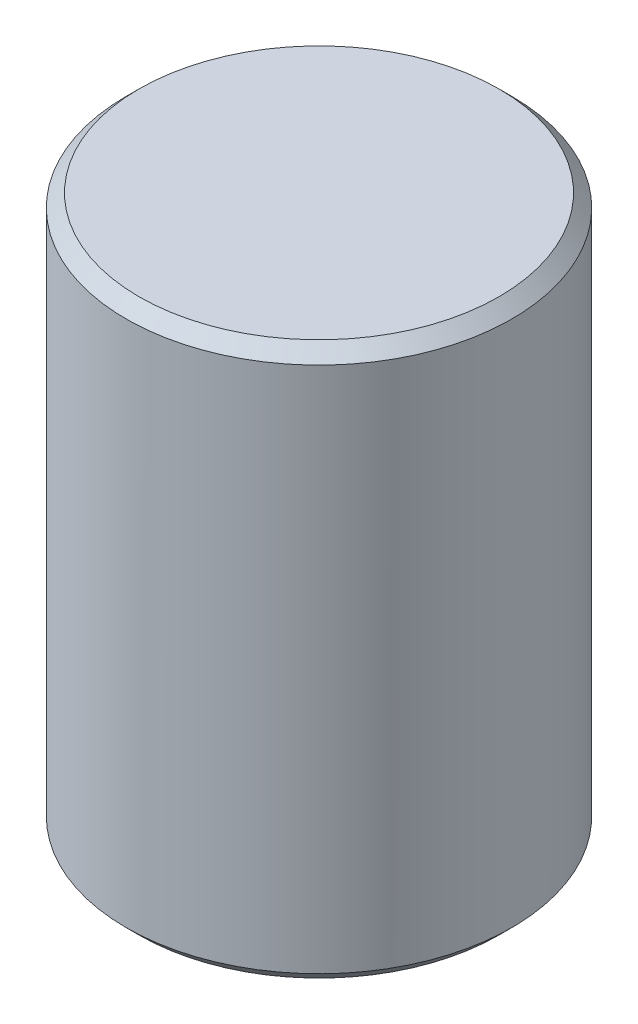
ISO-10303-21;
HEADER;
FILE_DESCRIPTION(('STEP AP214'),'2;1');
FILE_NAME('part.step','',(''),(''),'','','');
FILE_SCHEMA(('AUTOMOTIVE_DESIGN { 1 0 10303 214 1 1 1 1 }'));
ENDSEC;
DATA;
#1=APPLICATION_CONTEXT('core data for automotive mechanical design processes');
#2=APPLICATION_PROTOCOL_DEFINITION('international standard','automotive_design',2000,#1);
#3=PRODUCT_CONTEXT('',#1,'mechanical');
#4=PRODUCT('Part','Part','',(#3));
#5=PRODUCT_RELATED_PRODUCT_CATEGORY('part','',(#4));
#6=PRODUCT_DEFINITION_FORMATION('','',#4);
#7=PRODUCT_DEFINITION_CONTEXT('part definition',#1,'design');
#8=PRODUCT_DEFINITION('design','',#6,#7);
#9=PRODUCT_DEFINITION_SHAPE('','',#8);
#10=(LENGTH_UNIT() NAMED_UNIT(*) SI_UNIT(.MILLI.,.METRE.));
#11=(NAMED_UNIT(*) PLANE_ANGLE_UNIT() SI_UNIT($,.RADIAN.));
#12=(NAMED_UNIT(*) SI_UNIT($,.STERADIAN.) SOLID_ANGLE_UNIT());
#13=UNCERTAINTY_MEASURE_WITH_UNIT(LENGTH_MEASURE(1.E-05),#10,'distance_accuracy_value','');
#14=(GEOMETRIC_REPRESENTATION_CONTEXT(3) GLOBAL_UNCERTAINTY_ASSIGNED_CONTEXT((#13)) GLOBAL_UNIT_ASSIGNED_CONTEXT((#10,
#11,#12)) REPRESENTATION_CONTEXT('',''));
#15=CARTESIAN_POINT('',(0.,0.,0.));
#16=DIRECTION('',(0.,0.,1.));
#17=DIRECTION('',(1.,0.,0.));
#18=AXIS2_PLACEMENT_3D('',#15,#16,#17);
#19=CARTESIAN_POINT('',(0.,7.00000000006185,0.));
#20=DIRECTION('',(0.,-1.,0.));
#21=DIRECTION('',(0.,0.,-1.));
#22=AXIS2_PLACEMENT_3D('',#19,#20,#21);
#23=CONICAL_SURFACE('',#22,1.65000000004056,1.0821041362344);
#24=CARTESIAN_POINT('',(0.,7.87732056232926,0.));
#25=VERTEX_POINT('',#24);
#26=VERTEX_LOOP('',#25);
#27=FACE_BOUND('',#26,.T.);
#28=CARTESIAN_POINT('',(0.,7.00000000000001,0.));
#29=DIRECTION('',(0.,-1.,0.));
#30=DIRECTION('',(1.,0.,0.));
#31=AXIS2_PLACEMENT_3D('',#28,#29,#30);
#32=CIRCLE('',#31,1.65);
#33=CARTESIAN_POINT('',(1.65,7.00000000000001,0.));
#34=VERTEX_POINT('',#33);
#35=EDGE_CURVE('E32',#34,#34,#32,.T.);
#36=ORIENTED_EDGE('',*,*,#35,.T.);
#37=EDGE_LOOP('',(#36));
#38=FACE_BOUND('',#37,.T.);
#39=ADVANCED_FACE('F16',(#27,#38),#23,.F.);
#40=CARTESIAN_POINT('',(0.,8.27118659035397,0.));
#41=DIRECTION('',(0.,-1.,0.));
#42=DIRECTION('',(1.,0.,0.));
#43=AXIS2_PLACEMENT_3D('',#40,#41,#42);
#44=CYLINDRICAL_SURFACE('',#43,1.65);
#45=ORIENTED_EDGE('',*,*,#35,.F.);
#46=EDGE_LOOP('',(#45));
#47=FACE_BOUND('',#46,.T.);
#48=CARTESIAN_POINT('',(0.,0.,0.));
#49=DIRECTION('',(0.,-1.,0.));
#50=DIRECTION('',(1.,0.,0.));
#51=AXIS2_PLACEMENT_3D('',#48,#49,#50);
#52=CIRCLE('',#51,1.65);
#53=CARTESIAN_POINT('',(1.65,0.,0.));
#54=VERTEX_POINT('',#53);
#55=EDGE_CURVE('E19',#54,#54,#52,.T.);
#56=ORIENTED_EDGE('',*,*,#55,.T.);
#57=EDGE_LOOP('',(#56));
#58=FACE_BOUND('',#57,.T.);
#59=ADVANCED_FACE('F29',(#47,#58),#44,.F.);
#60=CARTESIAN_POINT('',(0.,0.,0.));
#61=DIRECTION('',(0.,1.,0.));
#62=DIRECTION('',(-1.,0.,0.));
#63=AXIS2_PLACEMENT_3D('',#60,#61,#62);
#64=PLANE('',#63);
#65=CARTESIAN_POINT('',(0.,0.,0.));
#66=DIRECTION('',(0.,1.,0.));
#67=DIRECTION('',(0.,0.,1.));
#68=AXIS2_PLACEMENT_3D('',#65,#66,#67);
#69=CIRCLE('',#68,7.00000000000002);
#70=CARTESIAN_POINT('',(0.,0.,7.00000000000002));
#71=VERTEX_POINT('',#70);
#72=EDGE_CURVE('E36',#71,#71,#69,.T.);
#73=ORIENTED_EDGE('',*,*,#72,.F.);
#74=EDGE_LOOP('',(#73));
#75=FACE_BOUND('',#74,.T.);
#76=ORIENTED_EDGE('',*,*,#55,.F.);
#77=EDGE_LOOP('',(#76));
#78=FACE_BOUND('',#77,.T.);
#79=ADVANCED_FACE('F46',(#75,#78),#64,.F.);
#80=CARTESIAN_POINT('',(0.,21.5,0.));
#81=DIRECTION('',(0.,1.,0.));
#82=DIRECTION('',(-1.,0.,0.));
#83=AXIS2_PLACEMENT_3D('',#80,#81,#82);
#84=PLANE('',#83);
#85=CARTESIAN_POINT('',(0.,21.5,0.));
#86=DIRECTION('',(0.,-1.,0.));
#87=DIRECTION('',(0.,0.,-1.));
#88=AXIS2_PLACEMENT_3D('',#85,#86,#87);
#89=CIRCLE('',#88,7.00000000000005);
#90=CARTESIAN_POINT('',(0.,21.5,-7.00000000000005));
#91=VERTEX_POINT('',#90);
#92=EDGE_CURVE('E39',#91,#91,#89,.T.);
#93=ORIENTED_EDGE('',*,*,#92,.F.);
#94=EDGE_LOOP('',(#93));
#95=FACE_BOUND('',#94,.T.);
#96=ADVANCED_FACE('F49',(#95),#84,.T.);
#97=CARTESIAN_POINT('',(0.,0.5,0.));
#98=DIRECTION('',(0.,1.,0.));
#99=DIRECTION('',(0.,0.,1.));
#100=AXIS2_PLACEMENT_3D('',#97,#98,#99);
#101=CONICAL_SURFACE('',#100,7.49999999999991,0.7853981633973);
#102=CARTESIAN_POINT('',(0.,0.5,0.));
#103=DIRECTION('',(0.,1.,0.));
#104=DIRECTION('',(-1.,0.,0.));
#105=AXIS2_PLACEMENT_3D('',#102,#103,#104);
#106=CIRCLE('',#105,7.5);
#107=CARTESIAN_POINT('',(-7.5,0.5,0.));
#108=VERTEX_POINT('',#107);
#109=EDGE_CURVE('E23',#108,#108,#106,.T.);
#110=ORIENTED_EDGE('',*,*,#109,.F.);
#111=EDGE_LOOP('',(#110));
#112=FACE_BOUND('',#111,.T.);
#113=ORIENTED_EDGE('',*,*,#72,.T.);
#114=EDGE_LOOP('',(#113));
#115=FACE_BOUND('',#114,.T.);
#116=ADVANCED_FACE('F44',(#112,#115),#101,.T.);
#117=CARTESIAN_POINT('',(0.,21.,0.));
#118=DIRECTION('',(0.,-1.,0.));
#119=DIRECTION('',(0.,0.,-1.));
#120=AXIS2_PLACEMENT_3D('',#117,#118,#119);
#121=CONICAL_SURFACE('',#120,7.49999999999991,0.785398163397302);
#122=CARTESIAN_POINT('',(0.,21.,0.));
#123=DIRECTION('',(0.,1.,0.));
#124=DIRECTION('',(-1.,0.,0.));
#125=AXIS2_PLACEMENT_3D('',#122,#123,#124);
#126=CIRCLE('',#125,7.5);
#127=CARTESIAN_POINT('',(-7.5,21.,0.));
#128=VERTEX_POINT('',#127);
#129=EDGE_CURVE('E11',#128,#128,#126,.F.);
#130=ORIENTED_EDGE('',*,*,#129,.F.);
#131=EDGE_LOOP('',(#130));
#132=FACE_BOUND('',#131,.T.);
#133=ORIENTED_EDGE('',*,*,#92,.T.);
#134=EDGE_LOOP('',(#133));
#135=FACE_BOUND('',#134,.T.);
#136=ADVANCED_FACE('F59',(#132,#135),#121,.T.);
#137=CARTESIAN_POINT('',(0.,0.,0.));
#138=DIRECTION('',(0.,1.,0.));
#139=DIRECTION('',(-1.,0.,0.));
#140=AXIS2_PLACEMENT_3D('',#137,#138,#139);
#141=CYLINDRICAL_SURFACE('',#140,7.5);
#142=ORIENTED_EDGE('',*,*,#129,.T.);
#143=EDGE_LOOP('',(#142));
#144=FACE_BOUND('',#143,.T.);
#145=ORIENTED_EDGE('',*,*,#109,.T.);
#146=EDGE_LOOP('',(#145));
#147=FACE_BOUND('',#146,.T.);
#148=ADVANCED_FACE('F57',(#144,#147),#141,.T.);
#149=CLOSED_SHELL('',(#39,#59,#79,#96,#116,#136,#148));
#150=MANIFOLD_SOLID_BREP('B1',#149);
#151=ADVANCED_BREP_SHAPE_REPRESENTATION('',(#18,#150),#14);
#152=SHAPE_DEFINITION_REPRESENTATION(#9,#151);
ENDSEC;
END-ISO-10303-21;
